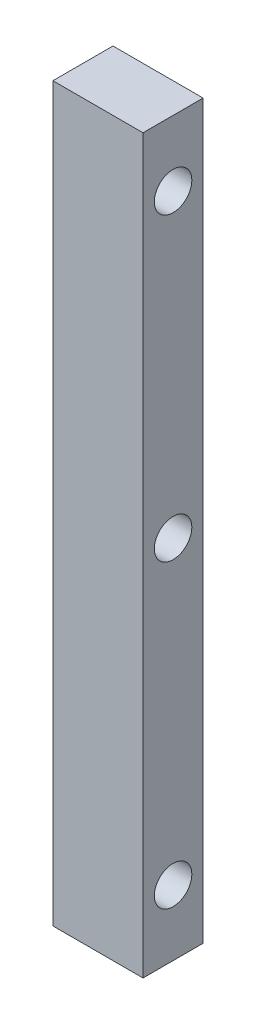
from build123d import *

# Parameters (mm, degrees)
EXTRUDE1_DEPTH      = 77.343
EXTRUDE1_DEPTH_BACK = 77.343
SKETCH1_W           = 19.05
SKETCH1_H           = 12.7
SKETCH2_R           = 3.9624
CUT_EXTRUDE1_DEPTH  = 81.660598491


with BuildPart() as part:
    # Sketch1 → Extrude1 (new, two sides: drawn at the far end of the back side and taken through both)
    with BuildSketch(Plane(origin=(0, 0, 0), x_dir=(1, 0, 0), z_dir=(0, 1, 0)).offset(-EXTRUDE1_DEPTH_BACK)):
        with Locations((-9.525, 6.35)):
            Rectangle(SKETCH1_W, SKETCH1_H)
    extrude(amount=EXTRUDE1_DEPTH + EXTRUDE1_DEPTH_BACK)

    # Sketch2 → Cut-Extrude1 (cut, through all)
    with BuildSketch(Plane(origin=(0, 0, 0), x_dir=(0, 0, -1), z_dir=(1, 0, 0))):
        with Locations((6.35, 63.5)):
            Circle(SKETCH2_R)
        with Locations((6.35, 0)):
            Circle(SKETCH2_R)
        with Locations((6.35, -63.5)):
            Circle(SKETCH2_R)
    extrude(amount=-CUT_EXTRUDE1_DEPTH, mode=Mode.SUBTRACT)


solid = part.part
